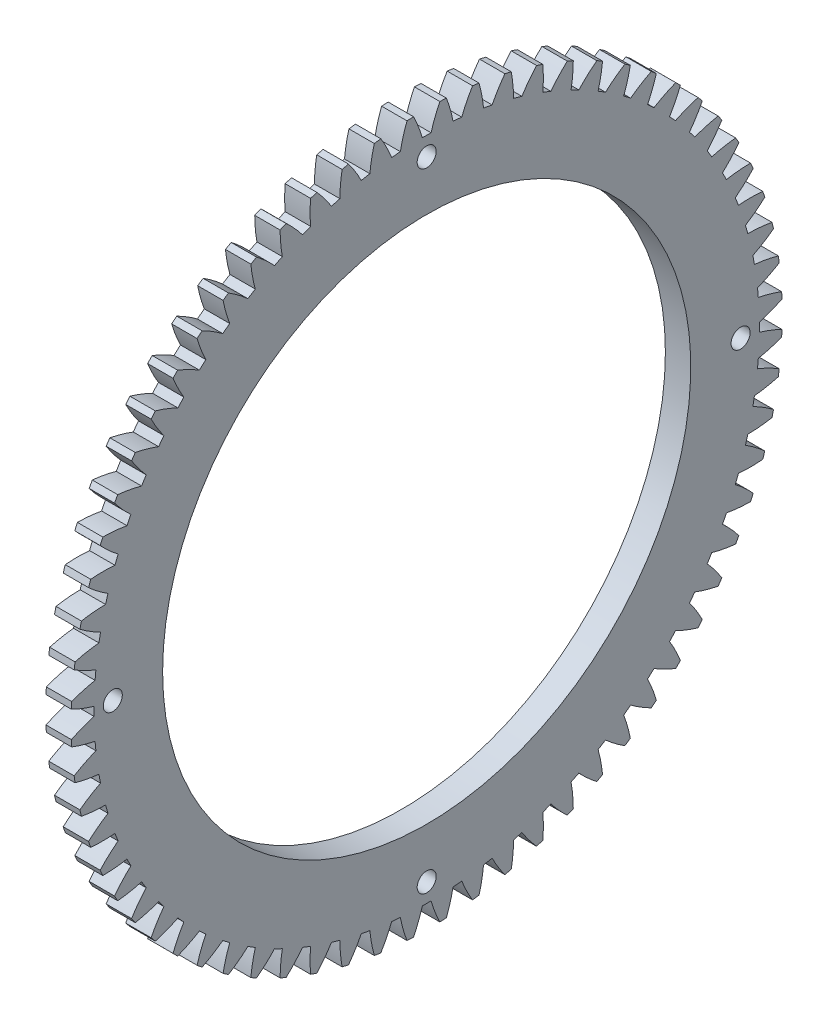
from build123d import *

# Parameters (mm, degrees)
BASPROSKE_W        = 6.35
BASPROSKE_H        = 88.9
TOOTHCUT_DEPTH     = 126.88384527
TEETHCUTS_COUNT    = 68
TEETHCUTS_ANGLE    = 354.705882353
BORSKE_R           = 66.04
BORE_DEPTH         = 50.8000508
SKETCH2_R          = 2.38125
CUT_EXTRUDE1_DEPTH = 126.797981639


with BuildPart() as part:
    # BasProSke → Base-Revolve (revolve)
    with BuildSketch(Plane(origin=(0, 0, 0), x_dir=(1, 0, 0), z_dir=(0, 1, 0)), mode=Mode.PRIVATE) as base_revolve_sk:
        with Locations((3.175, 44.45)):
            Rectangle(BASPROSKE_W, BASPROSKE_H)
    revolve(base_revolve_sk.sketch.rotate(Axis((-10, 0, 0), (1, 0, 0)), 180), axis=Axis((-10, 0, 0), (1, 0, 0)))

    # TooCutSke → ToothCut (cut, through all)
    with BuildSketch(Plane(origin=(0, 0, 0), x_dir=(0, 0, -1), z_dir=(1, 0, 0))):
        with BuildLine():
            ThreePointArc((1.090121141, 83.176586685), (0, 83.18373), (-1.090121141, 83.176586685))
            ThreePointArc((-1.090121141, 83.176586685), (-2.06895849, 86.069252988), (-3.299441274, 88.864168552))
            ThreePointArc((-3.299441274, 88.864168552), (0, 88.9254), (3.299441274, 88.864168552))
            ThreePointArc((3.299441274, 88.864168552), (2.06895849, 86.069252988), (1.090121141, 83.176586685))
        make_face()
    toothcut = extrude(amount=TOOTHCUT_DEPTH, mode=Mode.SUBTRACT)

    # TeethCuts: ToothCut ×68 about axis
    teethcuts_axis = Axis((-10, 0, 0), (1, 0, 0))
    for i in range(1, TEETHCUTS_COUNT):
        add(toothcut.rotate(teethcuts_axis, i * TEETHCUTS_ANGLE / (TEETHCUTS_COUNT - 1)), mode=Mode.SUBTRACT)

    # BorSke → Bore (cut, symmetric)
    with BuildSketch(Plane(origin=(0, 0, 0), x_dir=(0, 0, -1), z_dir=(1, 0, 0))):
        with Locations(Location((0, 0, 0), (0, 0, 180))):
            Circle(BORSKE_R)
    extrude(amount=BORE_DEPTH, both=True, mode=Mode.SUBTRACT)

    # Sketch2 → Cut-Extrude1 (cut, through all)
    with BuildSketch(Plane(origin=(6.35, 0, 0), x_dir=(0, 0, -1), z_dir=(1, 0, 0))):
        with Locations((0, 78.499999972)):
            Circle(SKETCH2_R)
        with Locations((78.499999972, 0)):
            Circle(SKETCH2_R)
        with Locations((0, -78.499999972)):
            Circle(SKETCH2_R)
        with Locations((-78.499999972, 0)):
            Circle(SKETCH2_R)
    extrude(amount=-CUT_EXTRUDE1_DEPTH, mode=Mode.SUBTRACT)


solid = part.part
